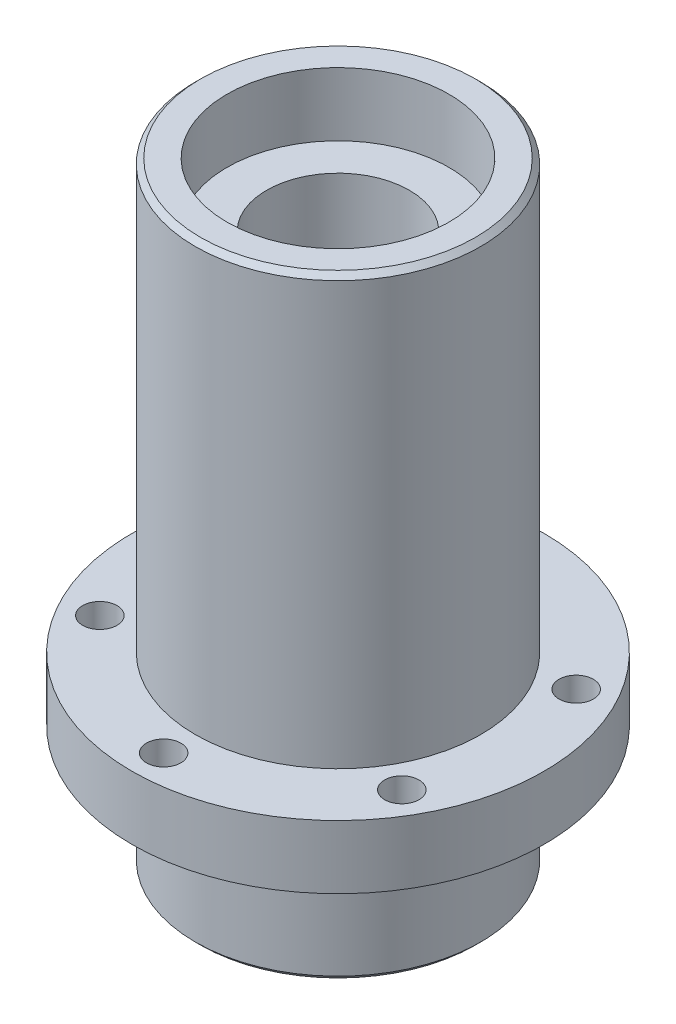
ISO-10303-21;
HEADER;
FILE_DESCRIPTION(('STEP AP214'),'2;1');
FILE_NAME('part.step','',(''),(''),'','','');
FILE_SCHEMA(('AUTOMOTIVE_DESIGN { 1 0 10303 214 1 1 1 1 }'));
ENDSEC;
DATA;
#1=APPLICATION_CONTEXT('core data for automotive mechanical design processes');
#2=APPLICATION_PROTOCOL_DEFINITION('international standard','automotive_design',2000,#1);
#3=PRODUCT_CONTEXT('',#1,'mechanical');
#4=PRODUCT('Part','Part','',(#3));
#5=PRODUCT_RELATED_PRODUCT_CATEGORY('part','',(#4));
#6=PRODUCT_DEFINITION_FORMATION('','',#4);
#7=PRODUCT_DEFINITION_CONTEXT('part definition',#1,'design');
#8=PRODUCT_DEFINITION('design','',#6,#7);
#9=PRODUCT_DEFINITION_SHAPE('','',#8);
#10=(LENGTH_UNIT() NAMED_UNIT(*) SI_UNIT(.MILLI.,.METRE.));
#11=(NAMED_UNIT(*) PLANE_ANGLE_UNIT() SI_UNIT($,.RADIAN.));
#12=(NAMED_UNIT(*) SI_UNIT($,.STERADIAN.) SOLID_ANGLE_UNIT());
#13=UNCERTAINTY_MEASURE_WITH_UNIT(LENGTH_MEASURE(1.E-05),#10,'distance_accuracy_value','');
#14=(GEOMETRIC_REPRESENTATION_CONTEXT(3) GLOBAL_UNCERTAINTY_ASSIGNED_CONTEXT((#13)) GLOBAL_UNIT_ASSIGNED_CONTEXT((#10,
#11,#12)) REPRESENTATION_CONTEXT('',''));
#15=CARTESIAN_POINT('',(0.,0.,0.));
#16=DIRECTION('',(0.,0.,1.));
#17=DIRECTION('',(1.,0.,0.));
#18=AXIS2_PLACEMENT_3D('',#15,#16,#17);
#19=CARTESIAN_POINT('',(0.,12.,0.));
#20=DIRECTION('',(0.,-1.,0.));
#21=DIRECTION('',(0.,0.,-1.));
#22=AXIS2_PLACEMENT_3D('',#19,#20,#21);
#23=CYLINDRICAL_SURFACE('',#22,21.);
#24=CARTESIAN_POINT('',(0.,0.,0.));
#25=DIRECTION('',(0.,-1.,0.));
#26=DIRECTION('',(0.,0.,-1.));
#27=AXIS2_PLACEMENT_3D('',#24,#25,#26);
#28=CIRCLE('',#27,21.);
#29=CARTESIAN_POINT('',(0.,0.,-21.));
#30=VERTEX_POINT('',#29);
#31=EDGE_CURVE('E18',#30,#30,#28,.T.);
#32=ORIENTED_EDGE('',*,*,#31,.T.);
#33=EDGE_LOOP('',(#32));
#34=FACE_BOUND('',#33,.T.);
#35=CARTESIAN_POINT('',(0.,12.,0.));
#36=DIRECTION('',(0.,-1.,0.));
#37=DIRECTION('',(0.,0.,-1.));
#38=AXIS2_PLACEMENT_3D('',#35,#36,#37);
#39=CIRCLE('',#38,21.);
#40=CARTESIAN_POINT('',(0.,12.,-21.));
#41=VERTEX_POINT('',#40);
#42=EDGE_CURVE('E94',#41,#41,#39,.T.);
#43=ORIENTED_EDGE('',*,*,#42,.F.);
#44=EDGE_LOOP('',(#43));
#45=FACE_BOUND('',#44,.T.);
#46=ADVANCED_FACE('F15',(#34,#45),#23,.F.);
#47=CARTESIAN_POINT('',(0.,0.,0.));
#48=DIRECTION('',(0.,1.,0.));
#49=DIRECTION('',(0.,0.,1.));
#50=AXIS2_PLACEMENT_3D('',#47,#48,#49);
#51=PLANE('',#50);
#52=ORIENTED_EDGE('',*,*,#31,.F.);
#53=EDGE_LOOP('',(#52));
#54=FACE_BOUND('',#53,.T.);
#55=CARTESIAN_POINT('',(0.,0.,0.));
#56=DIRECTION('',(0.,1.,0.));
#57=DIRECTION('',(0.,0.,1.));
#58=AXIS2_PLACEMENT_3D('',#55,#56,#57);
#59=CIRCLE('',#58,26.);
#60=CARTESIAN_POINT('',(0.,0.,26.));
#61=VERTEX_POINT('',#60);
#62=EDGE_CURVE('E92',#61,#61,#59,.T.);
#63=ORIENTED_EDGE('',*,*,#62,.F.);
#64=EDGE_LOOP('',(#63));
#65=FACE_BOUND('',#64,.T.);
#66=ADVANCED_FACE('F103',(#54,#65),#51,.F.);
#67=CARTESIAN_POINT('',(0.,12.,0.));
#68=DIRECTION('',(0.,-1.,0.));
#69=DIRECTION('',(0.,0.,-1.));
#70=AXIS2_PLACEMENT_3D('',#67,#68,#69);
#71=PLANE('',#70);
#72=ORIENTED_EDGE('',*,*,#42,.T.);
#73=EDGE_LOOP('',(#72));
#74=FACE_BOUND('',#73,.T.);
#75=CARTESIAN_POINT('',(0.,12.,0.));
#76=DIRECTION('',(0.,-1.,0.));
#77=DIRECTION('',(0.,0.,-1.));
#78=AXIS2_PLACEMENT_3D('',#75,#76,#77);
#79=CIRCLE('',#78,13.5);
#80=CARTESIAN_POINT('',(0.,12.,-13.5));
#81=VERTEX_POINT('',#80);
#82=EDGE_CURVE('E33',#81,#81,#79,.F.);
#83=ORIENTED_EDGE('',*,*,#82,.T.);
#84=EDGE_LOOP('',(#83));
#85=FACE_BOUND('',#84,.T.);
#86=ADVANCED_FACE('F106',(#74,#85),#71,.T.);
#87=CARTESIAN_POINT('',(0.,1.,0.));
#88=DIRECTION('',(0.,1.,0.));
#89=DIRECTION('',(0.,0.,1.));
#90=AXIS2_PLACEMENT_3D('',#87,#88,#89);
#91=CONICAL_SURFACE('',#90,27.,0.78539816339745);
#92=ORIENTED_EDGE('',*,*,#62,.T.);
#93=EDGE_LOOP('',(#92));
#94=FACE_BOUND('',#93,.T.);
#95=CARTESIAN_POINT('',(0.,1.,0.));
#96=DIRECTION('',(0.,-1.,0.));
#97=DIRECTION('',(0.,0.,-1.));
#98=AXIS2_PLACEMENT_3D('',#95,#96,#97);
#99=CIRCLE('',#98,27.);
#100=CARTESIAN_POINT('',(0.,1.,-27.));
#101=VERTEX_POINT('',#100);
#102=EDGE_CURVE('E30',#101,#101,#99,.F.);
#103=ORIENTED_EDGE('',*,*,#102,.F.);
#104=EDGE_LOOP('',(#103));
#105=FACE_BOUND('',#104,.T.);
#106=ADVANCED_FACE('F109',(#94,#105),#91,.T.);
#107=CARTESIAN_POINT('',(0.,116.,0.));
#108=DIRECTION('',(0.,-1.,0.));
#109=DIRECTION('',(0.,0.,-1.));
#110=AXIS2_PLACEMENT_3D('',#107,#108,#109);
#111=CYLINDRICAL_SURFACE('',#110,13.5);
#112=CARTESIAN_POINT('',(0.,104.,0.));
#113=DIRECTION('',(0.,-1.,0.));
#114=DIRECTION('',(0.,0.,-1.));
#115=AXIS2_PLACEMENT_3D('',#112,#113,#114);
#116=CIRCLE('',#115,13.5);
#117=CARTESIAN_POINT('',(0.,104.,-13.5));
#118=VERTEX_POINT('',#117);
#119=EDGE_CURVE('E32',#118,#118,#116,.T.);
#120=ORIENTED_EDGE('',*,*,#119,.F.);
#121=EDGE_LOOP('',(#120));
#122=FACE_BOUND('',#121,.T.);
#123=ORIENTED_EDGE('',*,*,#82,.F.);
#124=EDGE_LOOP('',(#123));
#125=FACE_BOUND('',#124,.T.);
#126=ADVANCED_FACE('F112',(#122,#125),#111,.F.);
#127=CARTESIAN_POINT('',(0.,23.,0.));
#128=DIRECTION('',(0.,-1.,0.));
#129=DIRECTION('',(0.,0.,-1.));
#130=AXIS2_PLACEMENT_3D('',#127,#128,#129);
#131=CYLINDRICAL_SURFACE('',#130,27.);
#132=CARTESIAN_POINT('',(0.,23.,0.));
#133=DIRECTION('',(0.,-1.,0.));
#134=DIRECTION('',(0.,0.,-1.));
#135=AXIS2_PLACEMENT_3D('',#132,#133,#134);
#136=CIRCLE('',#135,27.);
#137=CARTESIAN_POINT('',(0.,23.,-27.));
#138=VERTEX_POINT('',#137);
#139=EDGE_CURVE('E85',#138,#138,#136,.F.);
#140=ORIENTED_EDGE('',*,*,#139,.F.);
#141=EDGE_LOOP('',(#140));
#142=FACE_BOUND('',#141,.T.);
#143=ORIENTED_EDGE('',*,*,#102,.T.);
#144=EDGE_LOOP('',(#143));
#145=FACE_BOUND('',#144,.T.);
#146=ADVANCED_FACE('F116',(#142,#145),#131,.T.);
#147=CARTESIAN_POINT('',(0.,104.,0.));
#148=DIRECTION('',(0.,1.,0.));
#149=DIRECTION('',(0.,0.,1.));
#150=AXIS2_PLACEMENT_3D('',#147,#148,#149);
#151=PLANE('',#150);
#152=CARTESIAN_POINT('',(0.,104.,0.));
#153=DIRECTION('',(0.,1.,0.));
#154=DIRECTION('',(0.,0.,1.));
#155=AXIS2_PLACEMENT_3D('',#152,#153,#154);
#156=CIRCLE('',#155,21.);
#157=CARTESIAN_POINT('',(0.,104.,21.));
#158=VERTEX_POINT('',#157);
#159=EDGE_CURVE('E82',#158,#158,#156,.T.);
#160=ORIENTED_EDGE('',*,*,#159,.T.);
#161=EDGE_LOOP('',(#160));
#162=FACE_BOUND('',#161,.T.);
#163=ORIENTED_EDGE('',*,*,#119,.T.);
#164=EDGE_LOOP('',(#163));
#165=FACE_BOUND('',#164,.T.);
#166=ADVANCED_FACE('F118',(#162,#165),#151,.T.);
#167=CARTESIAN_POINT('',(0.,23.,0.));
#168=DIRECTION('',(0.,-1.,0.));
#169=DIRECTION('',(0.,0.,-1.));
#170=AXIS2_PLACEMENT_3D('',#167,#168,#169);
#171=PLANE('',#170);
#172=CARTESIAN_POINT('',(0.,23.,0.));
#173=DIRECTION('',(0.,-1.,0.));
#174=DIRECTION('',(0.,0.,-1.));
#175=AXIS2_PLACEMENT_3D('',#172,#173,#174);
#176=CIRCLE('',#175,39.);
#177=CARTESIAN_POINT('',(0.,23.,-39.));
#178=VERTEX_POINT('',#177);
#179=EDGE_CURVE('E61',#178,#178,#176,.F.);
#180=ORIENTED_EDGE('',*,*,#179,.F.);
#181=EDGE_LOOP('',(#180));
#182=FACE_BOUND('',#181,.T.);
#183=ORIENTED_EDGE('',*,*,#139,.T.);
#184=EDGE_LOOP('',(#183));
#185=FACE_BOUND('',#184,.T.);
#186=CARTESIAN_POINT('',(0.,23.,-33.));
#187=DIRECTION('',(0.,1.,0.));
#188=DIRECTION('',(0.,0.,1.));
#189=AXIS2_PLACEMENT_3D('',#186,#187,#188);
#190=CIRCLE('',#189,3.25);
#191=CARTESIAN_POINT('',(0.,23.,-29.75));
#192=VERTEX_POINT('',#191);
#193=EDGE_CURVE('E64',#192,#192,#190,.T.);
#194=ORIENTED_EDGE('',*,*,#193,.T.);
#195=EDGE_LOOP('',(#194));
#196=FACE_BOUND('',#195,.T.);
#197=CARTESIAN_POINT('',(28.5788383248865,23.,-16.4999999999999));
#198=DIRECTION('',(0.,1.,0.));
#199=DIRECTION('',(0.,0.,1.));
#200=AXIS2_PLACEMENT_3D('',#197,#198,#199);
#201=CIRCLE('',#200,3.25);
#202=CARTESIAN_POINT('',(28.5788383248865,23.,-13.2499999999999));
#203=VERTEX_POINT('',#202);
#204=EDGE_CURVE('E67',#203,#203,#201,.T.);
#205=ORIENTED_EDGE('',*,*,#204,.T.);
#206=EDGE_LOOP('',(#205));
#207=FACE_BOUND('',#206,.T.);
#208=CARTESIAN_POINT('',(28.5788383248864,23.,16.5000000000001));
#209=DIRECTION('',(0.,1.,0.));
#210=DIRECTION('',(0.,0.,1.));
#211=AXIS2_PLACEMENT_3D('',#208,#209,#210);
#212=CIRCLE('',#211,3.25);
#213=CARTESIAN_POINT('',(28.5788383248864,23.,19.7500000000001));
#214=VERTEX_POINT('',#213);
#215=EDGE_CURVE('E70',#214,#214,#212,.T.);
#216=ORIENTED_EDGE('',*,*,#215,.T.);
#217=EDGE_LOOP('',(#216));
#218=FACE_BOUND('',#217,.T.);
#219=CARTESIAN_POINT('',(0.,23.,33.));
#220=DIRECTION('',(0.,1.,0.));
#221=DIRECTION('',(0.,0.,1.));
#222=AXIS2_PLACEMENT_3D('',#219,#220,#221);
#223=CIRCLE('',#222,3.25);
#224=CARTESIAN_POINT('',(0.,23.,36.25));
#225=VERTEX_POINT('',#224);
#226=EDGE_CURVE('E73',#225,#225,#223,.T.);
#227=ORIENTED_EDGE('',*,*,#226,.T.);
#228=EDGE_LOOP('',(#227));
#229=FACE_BOUND('',#228,.T.);
#230=CARTESIAN_POINT('',(-28.5788383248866,23.,16.4999999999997));
#231=DIRECTION('',(0.,1.,0.));
#232=DIRECTION('',(0.,0.,1.));
#233=AXIS2_PLACEMENT_3D('',#230,#231,#232);
#234=CIRCLE('',#233,3.25);
#235=CARTESIAN_POINT('',(-28.5788383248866,23.,19.7499999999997));
#236=VERTEX_POINT('',#235);
#237=EDGE_CURVE('E76',#236,#236,#234,.T.);
#238=ORIENTED_EDGE('',*,*,#237,.T.);
#239=EDGE_LOOP('',(#238));
#240=FACE_BOUND('',#239,.T.);
#241=CARTESIAN_POINT('',(-28.5788383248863,23.,-16.5000000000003));
#242=DIRECTION('',(0.,1.,0.));
#243=DIRECTION('',(0.,0.,1.));
#244=AXIS2_PLACEMENT_3D('',#241,#242,#243);
#245=CIRCLE('',#244,3.25);
#246=CARTESIAN_POINT('',(-28.5788383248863,23.,-13.2500000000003));
#247=VERTEX_POINT('',#246);
#248=EDGE_CURVE('E79',#247,#247,#245,.T.);
#249=ORIENTED_EDGE('',*,*,#248,.T.);
#250=EDGE_LOOP('',(#249));
#251=FACE_BOUND('',#250,.T.);
#252=ADVANCED_FACE('F126',(#182,#185,#196,#207,#218,#229,#240,#251),#171,.T.);
#253=CARTESIAN_POINT('',(0.,104.,0.));
#254=DIRECTION('',(0.,1.,0.));
#255=DIRECTION('',(0.,0.,1.));
#256=AXIS2_PLACEMENT_3D('',#253,#254,#255);
#257=CYLINDRICAL_SURFACE('',#256,21.);
#258=CARTESIAN_POINT('',(0.,116.,0.));
#259=DIRECTION('',(0.,1.,0.));
#260=DIRECTION('',(0.,0.,1.));
#261=AXIS2_PLACEMENT_3D('',#258,#259,#260);
#262=CIRCLE('',#261,21.);
#263=CARTESIAN_POINT('',(0.,116.,21.));
#264=VERTEX_POINT('',#263);
#265=EDGE_CURVE('E58',#264,#264,#262,.F.);
#266=ORIENTED_EDGE('',*,*,#265,.F.);
#267=EDGE_LOOP('',(#266));
#268=FACE_BOUND('',#267,.T.);
#269=ORIENTED_EDGE('',*,*,#159,.F.);
#270=EDGE_LOOP('',(#269));
#271=FACE_BOUND('',#270,.T.);
#272=ADVANCED_FACE('F178',(#268,#271),#257,.F.);
#273=CARTESIAN_POINT('',(-28.5788383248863,0.,-16.5000000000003));
#274=DIRECTION('',(0.,1.,0.));
#275=DIRECTION('',(0.,0.,1.));
#276=AXIS2_PLACEMENT_3D('',#273,#274,#275);
#277=CYLINDRICAL_SURFACE('',#276,3.25);
#278=CARTESIAN_POINT('',(-28.5788383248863,35.,-16.5000000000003));
#279=DIRECTION('',(0.,1.,0.));
#280=DIRECTION('',(0.,0.,1.));
#281=AXIS2_PLACEMENT_3D('',#278,#279,#280);
#282=CIRCLE('',#281,3.25);
#283=CARTESIAN_POINT('',(-28.5788383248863,35.,-13.2500000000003));
#284=VERTEX_POINT('',#283);
#285=EDGE_CURVE('E55',#284,#284,#282,.F.);
#286=ORIENTED_EDGE('',*,*,#285,.F.);
#287=EDGE_LOOP('',(#286));
#288=FACE_BOUND('',#287,.T.);
#289=ORIENTED_EDGE('',*,*,#248,.F.);
#290=EDGE_LOOP('',(#289));
#291=FACE_BOUND('',#290,.T.);
#292=ADVANCED_FACE('F174',(#288,#291),#277,.F.);
#293=CARTESIAN_POINT('',(-28.5788383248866,0.,16.4999999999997));
#294=DIRECTION('',(0.,1.,0.));
#295=DIRECTION('',(0.,0.,1.));
#296=AXIS2_PLACEMENT_3D('',#293,#294,#295);
#297=CYLINDRICAL_SURFACE('',#296,3.25);
#298=CARTESIAN_POINT('',(-28.5788383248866,35.,16.4999999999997));
#299=DIRECTION('',(0.,1.,0.));
#300=DIRECTION('',(0.,0.,1.));
#301=AXIS2_PLACEMENT_3D('',#298,#299,#300);
#302=CIRCLE('',#301,3.25);
#303=CARTESIAN_POINT('',(-28.5788383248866,35.,19.7499999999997));
#304=VERTEX_POINT('',#303);
#305=EDGE_CURVE('E52',#304,#304,#302,.F.);
#306=ORIENTED_EDGE('',*,*,#305,.F.);
#307=EDGE_LOOP('',(#306));
#308=FACE_BOUND('',#307,.T.);
#309=ORIENTED_EDGE('',*,*,#237,.F.);
#310=EDGE_LOOP('',(#309));
#311=FACE_BOUND('',#310,.T.);
#312=ADVANCED_FACE('F170',(#308,#311),#297,.F.);
#313=CARTESIAN_POINT('',(0.,0.,33.));
#314=DIRECTION('',(0.,1.,0.));
#315=DIRECTION('',(0.,0.,1.));
#316=AXIS2_PLACEMENT_3D('',#313,#314,#315);
#317=CYLINDRICAL_SURFACE('',#316,3.25);
#318=CARTESIAN_POINT('',(0.,35.,33.));
#319=DIRECTION('',(0.,1.,0.));
#320=DIRECTION('',(0.,0.,1.));
#321=AXIS2_PLACEMENT_3D('',#318,#319,#320);
#322=CIRCLE('',#321,3.25);
#323=CARTESIAN_POINT('',(0.,35.,36.25));
#324=VERTEX_POINT('',#323);
#325=EDGE_CURVE('E49',#324,#324,#322,.F.);
#326=ORIENTED_EDGE('',*,*,#325,.F.);
#327=EDGE_LOOP('',(#326));
#328=FACE_BOUND('',#327,.T.);
#329=ORIENTED_EDGE('',*,*,#226,.F.);
#330=EDGE_LOOP('',(#329));
#331=FACE_BOUND('',#330,.T.);
#332=ADVANCED_FACE('F166',(#328,#331),#317,.F.);
#333=CARTESIAN_POINT('',(28.5788383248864,0.,16.5000000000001));
#334=DIRECTION('',(0.,1.,0.));
#335=DIRECTION('',(0.,0.,1.));
#336=AXIS2_PLACEMENT_3D('',#333,#334,#335);
#337=CYLINDRICAL_SURFACE('',#336,3.25);
#338=CARTESIAN_POINT('',(28.5788383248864,35.,16.5000000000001));
#339=DIRECTION('',(0.,1.,0.));
#340=DIRECTION('',(0.,0.,1.));
#341=AXIS2_PLACEMENT_3D('',#338,#339,#340);
#342=CIRCLE('',#341,3.25);
#343=CARTESIAN_POINT('',(28.5788383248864,35.,19.7500000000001));
#344=VERTEX_POINT('',#343);
#345=EDGE_CURVE('E46',#344,#344,#342,.F.);
#346=ORIENTED_EDGE('',*,*,#345,.F.);
#347=EDGE_LOOP('',(#346));
#348=FACE_BOUND('',#347,.T.);
#349=ORIENTED_EDGE('',*,*,#215,.F.);
#350=EDGE_LOOP('',(#349));
#351=FACE_BOUND('',#350,.T.);
#352=ADVANCED_FACE('F162',(#348,#351),#337,.F.);
#353=CARTESIAN_POINT('',(28.5788383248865,0.,-16.4999999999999));
#354=DIRECTION('',(0.,1.,0.));
#355=DIRECTION('',(0.,0.,1.));
#356=AXIS2_PLACEMENT_3D('',#353,#354,#355);
#357=CYLINDRICAL_SURFACE('',#356,3.25);
#358=CARTESIAN_POINT('',(28.5788383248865,35.,-16.4999999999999));
#359=DIRECTION('',(0.,1.,0.));
#360=DIRECTION('',(0.,0.,1.));
#361=AXIS2_PLACEMENT_3D('',#358,#359,#360);
#362=CIRCLE('',#361,3.25);
#363=CARTESIAN_POINT('',(28.5788383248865,35.,-13.2499999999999));
#364=VERTEX_POINT('',#363);
#365=EDGE_CURVE('E43',#364,#364,#362,.F.);
#366=ORIENTED_EDGE('',*,*,#365,.F.);
#367=EDGE_LOOP('',(#366));
#368=FACE_BOUND('',#367,.T.);
#369=ORIENTED_EDGE('',*,*,#204,.F.);
#370=EDGE_LOOP('',(#369));
#371=FACE_BOUND('',#370,.T.);
#372=ADVANCED_FACE('F158',(#368,#371),#357,.F.);
#373=CARTESIAN_POINT('',(0.,0.,-33.));
#374=DIRECTION('',(0.,1.,0.));
#375=DIRECTION('',(0.,0.,1.));
#376=AXIS2_PLACEMENT_3D('',#373,#374,#375);
#377=CYLINDRICAL_SURFACE('',#376,3.25);
#378=CARTESIAN_POINT('',(0.,35.,-33.));
#379=DIRECTION('',(0.,1.,0.));
#380=DIRECTION('',(0.,0.,1.));
#381=AXIS2_PLACEMENT_3D('',#378,#379,#380);
#382=CIRCLE('',#381,3.25);
#383=CARTESIAN_POINT('',(0.,35.,-29.75));
#384=VERTEX_POINT('',#383);
#385=EDGE_CURVE('E40',#384,#384,#382,.F.);
#386=ORIENTED_EDGE('',*,*,#385,.F.);
#387=EDGE_LOOP('',(#386));
#388=FACE_BOUND('',#387,.T.);
#389=ORIENTED_EDGE('',*,*,#193,.F.);
#390=EDGE_LOOP('',(#389));
#391=FACE_BOUND('',#390,.T.);
#392=ADVANCED_FACE('F154',(#388,#391),#377,.F.);
#393=CARTESIAN_POINT('',(0.,116.,0.));
#394=DIRECTION('',(0.,-1.,0.));
#395=DIRECTION('',(0.,0.,-1.));
#396=AXIS2_PLACEMENT_3D('',#393,#394,#395);
#397=CYLINDRICAL_SURFACE('',#396,39.);
#398=ORIENTED_EDGE('',*,*,#179,.T.);
#399=EDGE_LOOP('',(#398));
#400=FACE_BOUND('',#399,.T.);
#401=CARTESIAN_POINT('',(0.,35.,0.));
#402=DIRECTION('',(0.,-1.,0.));
#403=DIRECTION('',(0.,0.,-1.));
#404=AXIS2_PLACEMENT_3D('',#401,#402,#403);
#405=CIRCLE('',#404,39.);
#406=CARTESIAN_POINT('',(0.,35.,-39.));
#407=VERTEX_POINT('',#406);
#408=EDGE_CURVE('E37',#407,#407,#405,.F.);
#409=ORIENTED_EDGE('',*,*,#408,.F.);
#410=EDGE_LOOP('',(#409));
#411=FACE_BOUND('',#410,.T.);
#412=ADVANCED_FACE('F150',(#400,#411),#397,.T.);
#413=CARTESIAN_POINT('',(0.,116.,0.));
#414=DIRECTION('',(0.,1.,0.));
#415=DIRECTION('',(0.,0.,1.));
#416=AXIS2_PLACEMENT_3D('',#413,#414,#415);
#417=PLANE('',#416);
#418=ORIENTED_EDGE('',*,*,#265,.T.);
#419=EDGE_LOOP('',(#418));
#420=FACE_BOUND('',#419,.T.);
#421=CARTESIAN_POINT('',(0.,116.,0.));
#422=DIRECTION('',(0.,-1.,0.));
#423=DIRECTION('',(0.,0.,-1.));
#424=AXIS2_PLACEMENT_3D('',#421,#422,#423);
#425=CIRCLE('',#424,26.);
#426=CARTESIAN_POINT('',(0.,116.,-26.));
#427=VERTEX_POINT('',#426);
#428=EDGE_CURVE('E27',#427,#427,#425,.T.);
#429=ORIENTED_EDGE('',*,*,#428,.F.);
#430=EDGE_LOOP('',(#429));
#431=FACE_BOUND('',#430,.T.);
#432=ADVANCED_FACE('F146',(#420,#431),#417,.T.);
#433=CARTESIAN_POINT('',(0.,35.,0.));
#434=DIRECTION('',(0.,1.,0.));
#435=DIRECTION('',(0.,0.,1.));
#436=AXIS2_PLACEMENT_3D('',#433,#434,#435);
#437=PLANE('',#436);
#438=ORIENTED_EDGE('',*,*,#408,.T.);
#439=EDGE_LOOP('',(#438));
#440=FACE_BOUND('',#439,.T.);
#441=CARTESIAN_POINT('',(0.,35.,0.));
#442=DIRECTION('',(0.,1.,0.));
#443=DIRECTION('',(0.,0.,1.));
#444=AXIS2_PLACEMENT_3D('',#441,#442,#443);
#445=CIRCLE('',#444,27.);
#446=CARTESIAN_POINT('',(0.,35.,27.));
#447=VERTEX_POINT('',#446);
#448=EDGE_CURVE('E22',#447,#447,#445,.T.);
#449=ORIENTED_EDGE('',*,*,#448,.F.);
#450=EDGE_LOOP('',(#449));
#451=FACE_BOUND('',#450,.T.);
#452=ORIENTED_EDGE('',*,*,#385,.T.);
#453=EDGE_LOOP('',(#452));
#454=FACE_BOUND('',#453,.T.);
#455=ORIENTED_EDGE('',*,*,#365,.T.);
#456=EDGE_LOOP('',(#455));
#457=FACE_BOUND('',#456,.T.);
#458=ORIENTED_EDGE('',*,*,#345,.T.);
#459=EDGE_LOOP('',(#458));
#460=FACE_BOUND('',#459,.T.);
#461=ORIENTED_EDGE('',*,*,#325,.T.);
#462=EDGE_LOOP('',(#461));
#463=FACE_BOUND('',#462,.T.);
#464=ORIENTED_EDGE('',*,*,#305,.T.);
#465=EDGE_LOOP('',(#464));
#466=FACE_BOUND('',#465,.T.);
#467=ORIENTED_EDGE('',*,*,#285,.T.);
#468=EDGE_LOOP('',(#467));
#469=FACE_BOUND('',#468,.T.);
#470=ADVANCED_FACE('F139',(#440,#451,#454,#457,#460,#463,#466,#469),#437,.T.);
#471=CARTESIAN_POINT('',(0.,115.,0.));
#472=DIRECTION('',(0.,-1.,0.));
#473=DIRECTION('',(0.,0.,-1.));
#474=AXIS2_PLACEMENT_3D('',#471,#472,#473);
#475=CONICAL_SURFACE('',#474,27.,0.785398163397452);
#476=CARTESIAN_POINT('',(0.,115.,0.));
#477=DIRECTION('',(0.,1.,0.));
#478=DIRECTION('',(0.,0.,1.));
#479=AXIS2_PLACEMENT_3D('',#476,#477,#478);
#480=CIRCLE('',#479,27.);
#481=CARTESIAN_POINT('',(0.,115.,27.));
#482=VERTEX_POINT('',#481);
#483=EDGE_CURVE('E10',#482,#482,#480,.F.);
#484=ORIENTED_EDGE('',*,*,#483,.F.);
#485=EDGE_LOOP('',(#484));
#486=FACE_BOUND('',#485,.T.);
#487=ORIENTED_EDGE('',*,*,#428,.T.);
#488=EDGE_LOOP('',(#487));
#489=FACE_BOUND('',#488,.T.);
#490=ADVANCED_FACE('F134',(#486,#489),#475,.T.);
#491=CARTESIAN_POINT('',(0.,35.,0.));
#492=DIRECTION('',(0.,1.,0.));
#493=DIRECTION('',(0.,0.,1.));
#494=AXIS2_PLACEMENT_3D('',#491,#492,#493);
#495=CYLINDRICAL_SURFACE('',#494,27.);
#496=ORIENTED_EDGE('',*,*,#483,.T.);
#497=EDGE_LOOP('',(#496));
#498=FACE_BOUND('',#497,.T.);
#499=ORIENTED_EDGE('',*,*,#448,.T.);
#500=EDGE_LOOP('',(#499));
#501=FACE_BOUND('',#500,.T.);
#502=ADVANCED_FACE('F132',(#498,#501),#495,.T.);
#503=CLOSED_SHELL('',(#46,#66,#86,#106,#126,#146,#166,#252,#272,#292,#312,#332,#352,#372,#392,
#412,#432,#470,#490,#502));
#504=MANIFOLD_SOLID_BREP('B1',#503);
#505=ADVANCED_BREP_SHAPE_REPRESENTATION('',(#18,#504),#14);
#506=SHAPE_DEFINITION_REPRESENTATION(#9,#505);
ENDSEC;
END-ISO-10303-21;
